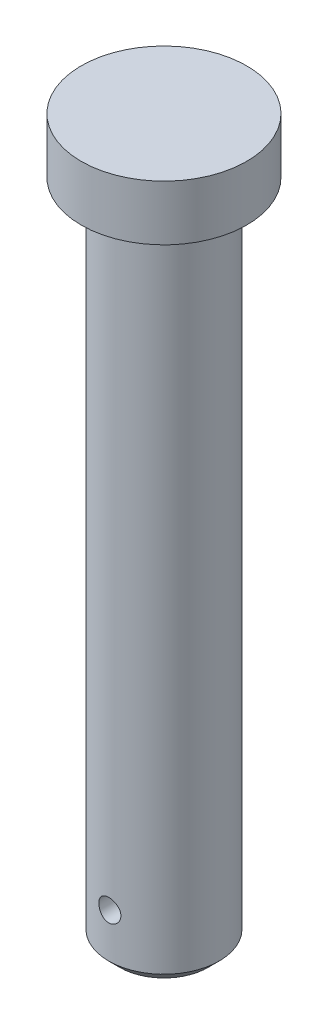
from build123d import *

# Parameters (mm, degrees)
ESQUISSE1_R           = 10
EXTRUSION1_DEPTH      = 120
ESQUISSE2_R           = 15
EXTRUSION2_DEPTH      = 10
EXTRUSION3_DEPTH      = 132.719398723
EXTRUSION3_DEPTH_BACK = 132.719398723
ESQUISSE3_R           = 2
CHANFREIN1_SIZE       = 2


with BuildPart() as part:
    # Esquisse1 → Extrusion1 (new body)
    with BuildSketch(Plane(origin=(0, 0, 0), x_dir=(1, 0, 0), z_dir=(0, 1, 0))):
        with Locations(Location((0, 0, 0), (0, 0, 270))):
            Circle(ESQUISSE1_R)
    extrude(amount=EXTRUSION1_DEPTH)

    # Esquisse2 → Extrusion2 (add)
    with BuildSketch(Plane(origin=(0, 120, 0), x_dir=(1, 0, 0), z_dir=(0, 1, 0))):
        with Locations(Location((0, 0, 0), (0, 0, 270))):
            Circle(ESQUISSE2_R)
    extrude(amount=EXTRUSION2_DEPTH)

    # Esquisse3 → Extrusion3 (cut, two sides: drawn at the far end of the back side and taken through both)
    with BuildSketch(Plane.XY.offset(-EXTRUSION3_DEPTH_BACK)):
        with Locations(Location((0, 10, 0), (0, 0, 89.999999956))):
            Circle(ESQUISSE3_R)
    extrude(amount=EXTRUSION3_DEPTH + EXTRUSION3_DEPTH_BACK, mode=Mode.SUBTRACT)

    # Chanfrein1
    chanfrein1_edges = [part.edges().sort_by_distance(p)[0] for p in [
        (0, 0, -10),
    ]]
    chamfer(chanfrein1_edges, length=CHANFREIN1_SIZE)


solid = part.part
